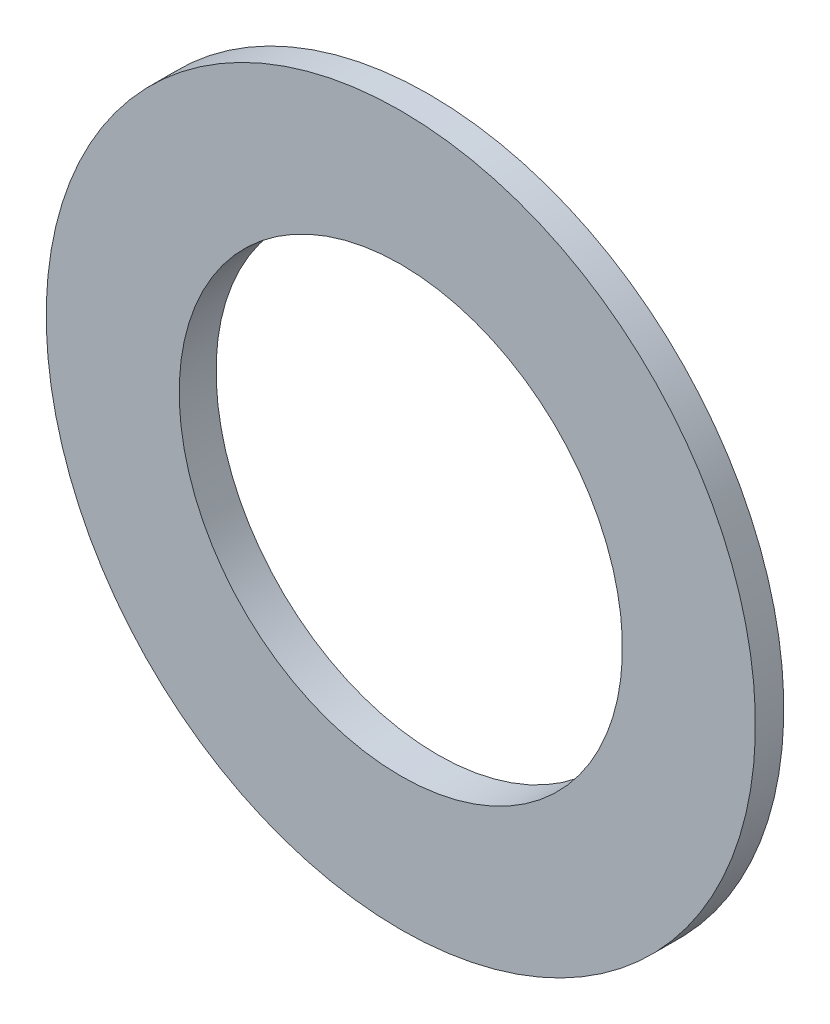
from build123d import *

# Parameters (mm, degrees)
F_3_4_CLEARANCE_HOLE1_D     = 19.84248
F_3_4_CLEARANCE_HOLE1_DEPTH = 5.842
F_3_4_CLEARANCE_HOLE1_TIP   = 5.961282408
SKETCH11_R                  = 26.97150997
SKETCH11_R_2                = 15.875
CUT_EXTRUDE1_DEPTH          = 32.567273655
SKETCH12_W                  = 2.391723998
SKETCH12_H                  = 38.475559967
CUT_EXTRUDE2_DEPTH          = 25.4


with BuildPart() as part:
    # Sketch4 → Revolve1 (revolve)
    with BuildSketch(Plane(origin=(0, 0, 0), x_dir=(0, 0, -1), z_dir=(1, 0, 0))):
        with BuildLine():
            Line((0, 0), (-3.175, 0))
            Line((-3.175, 0), (-3.175, 22.225))
            Line((-3.175, 22.225), (-1.226800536, 22.225))
            ThreePointArc((-1.226800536, 22.225), (-0.306933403, 11.129416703), (0, 0))
        make_face()
    revolve(axis=Axis((0, 0, 57.98599554), (0, 0, -1)))

    # 3_4 Clearance Hole1
    with Locations(Plane.XY.offset(3.175)):
        with Locations((0, 0)):
            Hole(F_3_4_CLEARANCE_HOLE1_D / 2, depth=F_3_4_CLEARANCE_HOLE1_DEPTH)
            with Locations((0, 0, -(F_3_4_CLEARANCE_HOLE1_DEPTH + F_3_4_CLEARANCE_HOLE1_TIP / 2))):  # 118° drill point
                Cone(0, F_3_4_CLEARANCE_HOLE1_D / 2, F_3_4_CLEARANCE_HOLE1_TIP, mode=Mode.SUBTRACT)

    # Sketch11 → Cut-Extrude1 (cut, through all)
    with BuildSketch(Plane.XY.offset(3.175)):
        Circle(SKETCH11_R)
        Circle(SKETCH11_R_2, mode=Mode.SUBTRACT)
    extrude(amount=-CUT_EXTRUDE1_DEPTH, mode=Mode.SUBTRACT)

    # Sketch12 → Cut-Extrude2 (cut, symmetric)
    with BuildSketch(Plane(origin=(0, 0, 0), x_dir=(0, 0, -1), z_dir=(1, 0, 0))):
        with Locations((-3.090846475, -0.753912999)):
            Rectangle(SKETCH12_W, SKETCH12_H)
    extrude(amount=CUT_EXTRUDE2_DEPTH, both=True, mode=Mode.SUBTRACT)


solid = part.part
